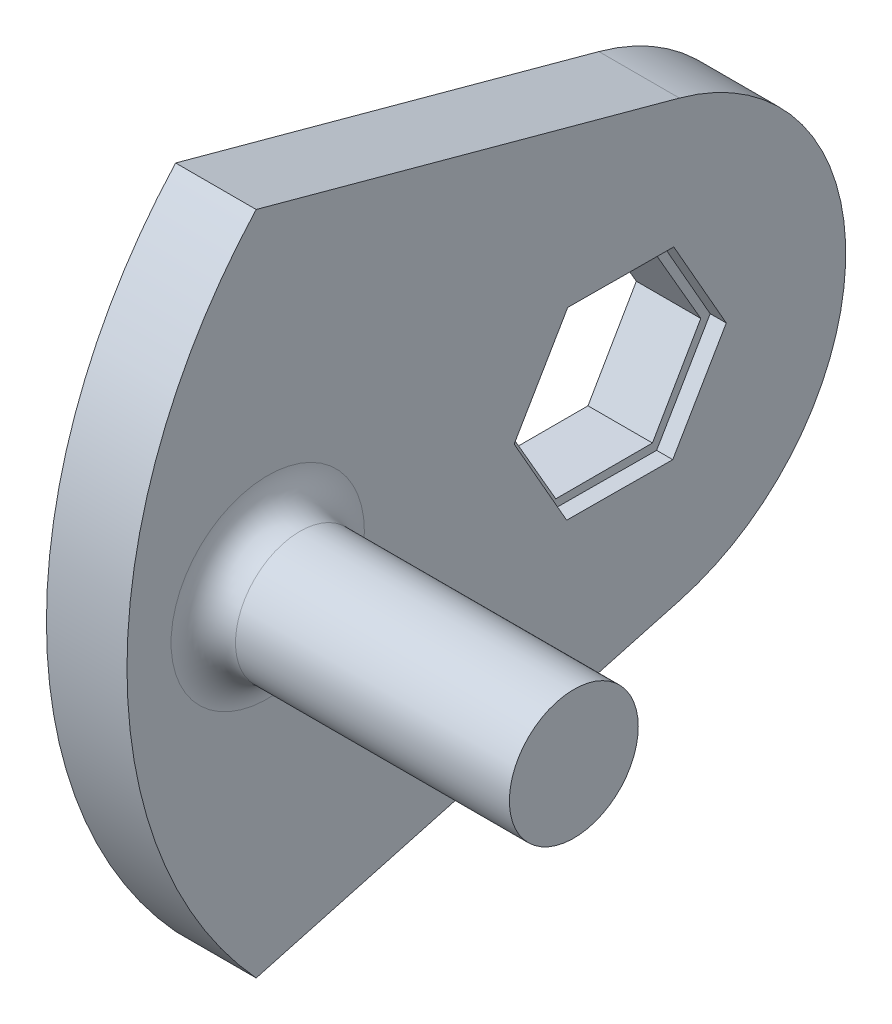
from build123d import *

# Parameters (mm, degrees)
SKETCH1_R           = 6
BOSS_EXTRUDE1_DEPTH = 5
SKETCH1_3_R         = 6
BOSS_EXTRUDE2_DEPTH = 5
SKETCH1_4_R         = 4
BOSS_EXTRUDE3_DEPTH = 24
FILLET1_R           = 2
CUT_EXTRUDE1_DEPTH  = 1


with BuildPart() as part:
    # Sketch1 → Boss-Extrude1 (new body)
    with BuildSketch(Plane(origin=(0, 0, 0), x_dir=(0, 0, -1), z_dir=(1, 0, 0))):
        with BuildLine():
            Line((3.675008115, 13.509045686), (-22.597532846, 20.656241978))
            ThreePointArc((-22.597532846, 20.656241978), (-30.615826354, 0), (-22.597532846, -20.656241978))
            Line((-22.597532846, -20.656241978), (3.675008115, -13.509045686))
            ThreePointArc((3.675008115, -13.509045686), (14, 0), (3.675008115, 13.509045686))
        make_face()
        with Locations((-21.88, 0)):
            Circle(SKETCH1_R, mode=Mode.SUBTRACT)
        Polygon((3, 5.196152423), (-3, 5.196152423), (-6, 0), (-3, -5.196152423), (3, -5.196152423), (6, 0), align=None, mode=Mode.SUBTRACT)
    extrude(amount=BOSS_EXTRUDE1_DEPTH)

    # Sketch1_3 → Boss-Extrude2 (add)
    with BuildSketch(Plane(origin=(0, 0, 0), x_dir=(0, 0, -1), z_dir=(1, 0, 0))):
        with Locations((-21.88, 0)):
            Circle(SKETCH1_3_R)
    extrude(amount=BOSS_EXTRUDE2_DEPTH)

    # Sketch1_4 → Boss-Extrude3 (add)
    with BuildSketch(Plane(origin=(0, 0, 0), x_dir=(0, 0, -1), z_dir=(1, 0, 0))):
        with Locations((-21.88, 0)):
            Circle(SKETCH1_4_R)
    extrude(amount=BOSS_EXTRUDE3_DEPTH)

    # Fillet1
    fillet1_edges = [part.edges().sort_by_distance(p)[0] for p in [
        (5, 0, 25.88),
    ]]
    fillet(fillet1_edges, radius=FILLET1_R)

    # Sketch2 → Cut-Extrude1 (cut)
    with BuildSketch(Plane(origin=(5, 0, 0), x_dir=(0, 0, -1), z_dir=(1, 0, 0))):
        Polygon((3.323947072, 5.682997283), (-3.259646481, 5.720121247), (-6.583593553, 0.037123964), (-3.323947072, -5.682997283), (3.259646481, -5.720121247), (6.583593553, -0.037123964), align=None)
    extrude(amount=-CUT_EXTRUDE1_DEPTH, mode=Mode.SUBTRACT)


solid = part.part
